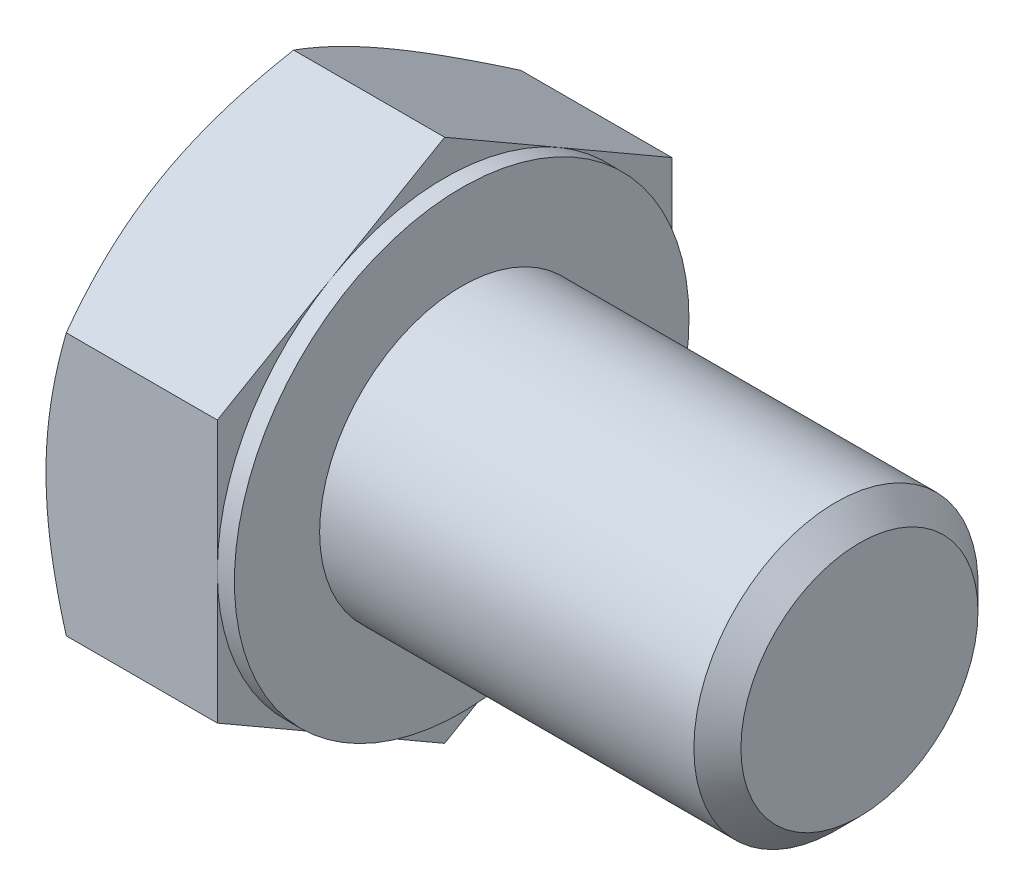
ISO-10303-21;
HEADER;
FILE_DESCRIPTION(('STEP AP214'),'2;1');
FILE_NAME('part.step','',(''),(''),'','','');
FILE_SCHEMA(('AUTOMOTIVE_DESIGN { 1 0 10303 214 1 1 1 1 }'));
ENDSEC;
DATA;
#1=APPLICATION_CONTEXT('core data for automotive mechanical design processes');
#2=APPLICATION_PROTOCOL_DEFINITION('international standard','automotive_design',2000,#1);
#3=PRODUCT_CONTEXT('',#1,'mechanical');
#4=PRODUCT('Part','Part','',(#3));
#5=PRODUCT_RELATED_PRODUCT_CATEGORY('part','',(#4));
#6=PRODUCT_DEFINITION_FORMATION('','',#4);
#7=PRODUCT_DEFINITION_CONTEXT('part definition',#1,'design');
#8=PRODUCT_DEFINITION('design','',#6,#7);
#9=PRODUCT_DEFINITION_SHAPE('','',#8);
#10=(LENGTH_UNIT() NAMED_UNIT(*) SI_UNIT(.MILLI.,.METRE.));
#11=(NAMED_UNIT(*) PLANE_ANGLE_UNIT() SI_UNIT($,.RADIAN.));
#12=(NAMED_UNIT(*) SI_UNIT($,.STERADIAN.) SOLID_ANGLE_UNIT());
#13=UNCERTAINTY_MEASURE_WITH_UNIT(LENGTH_MEASURE(1.E-05),#10,'distance_accuracy_value','');
#14=(GEOMETRIC_REPRESENTATION_CONTEXT(3) GLOBAL_UNCERTAINTY_ASSIGNED_CONTEXT((#13)) GLOBAL_UNIT_ASSIGNED_CONTEXT((#10,
#11,#12)) REPRESENTATION_CONTEXT('',''));
#15=CARTESIAN_POINT('',(0.,0.,0.));
#16=DIRECTION('',(0.,0.,1.));
#17=DIRECTION('',(1.,0.,0.));
#18=AXIS2_PLACEMENT_3D('',#15,#16,#17);
#19=CARTESIAN_POINT('',(6.63,4.618802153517,-8.));
#20=DIRECTION('',(0.,-0.866025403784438,0.500000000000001));
#21=DIRECTION('',(0.,-0.500000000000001,-0.866025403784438));
#22=AXIS2_PLACEMENT_3D('',#19,#20,#21);
#23=PLANE('',#22);
#24=DIRECTION('',(0.,0.500000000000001,0.866025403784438));
#25=VECTOR('',#24,1.);
#26=CARTESIAN_POINT('',(6.03,4.618802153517,-8.));
#27=LINE('',#26,#25);
#28=CARTESIAN_POINT('',(6.03,4.618802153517,-8.));
#29=VERTEX_POINT('',#28);
#30=CARTESIAN_POINT('',(6.03,6.92820323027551,-4.00000000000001));
#31=VERTEX_POINT('',#30);
#32=EDGE_CURVE('E169',#29,#31,#27,.T.);
#33=ORIENTED_EDGE('',*,*,#32,.F.);
#34=DIRECTION('',(-1.,0.,0.));
#35=VECTOR('',#34,1.);
#36=CARTESIAN_POINT('',(6.63,4.618802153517,-8.));
#37=LINE('',#36,#35);
#38=CARTESIAN_POINT('',(0.714531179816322,4.618802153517,-8.));
#39=VERTEX_POINT('',#38);
#40=EDGE_CURVE('E302',#29,#39,#37,.T.);
#41=ORIENTED_EDGE('',*,*,#40,.T.);
#42=CARTESIAN_POINT('',(0.714597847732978,9.23771977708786,0.000200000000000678));
#43=CARTESIAN_POINT('',(0.655990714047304,9.13619343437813,-0.175648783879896));
#44=CARTESIAN_POINT('',(0.600043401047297,9.03428856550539,-0.352153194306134));
#45=CARTESIAN_POINT('',(0.494201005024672,8.82965122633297,-0.706595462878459));
#46=CARTESIAN_POINT('',(0.444308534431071,8.72691841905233,-0.884533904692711));
#47=CARTESIAN_POINT('',(0.304692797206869,8.41707512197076,-1.42119823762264));
#48=CARTESIAN_POINT('',(0.225281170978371,8.20874154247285,-1.78204258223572));
#49=CARTESIAN_POINT('',(0.132161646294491,7.89697436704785,-2.32203917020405));
#50=CARTESIAN_POINT('',(0.105634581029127,7.79447216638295,-2.49957818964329));
#51=CARTESIAN_POINT('',(0.0611531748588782,7.58900421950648,-2.8554591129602));
#52=CARTESIAN_POINT('',(0.0431980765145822,7.4860385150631,-3.03380094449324));
#53=CARTESIAN_POINT('',(0.0163156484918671,7.27992981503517,-3.39079168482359));
#54=CARTESIAN_POINT('',(0.00737807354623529,7.17678715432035,-3.5694400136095));
#55=CARTESIAN_POINT('',(-0.00127769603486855,6.97040655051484,-3.92690170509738));
#56=CARTESIAN_POINT('',(-0.000996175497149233,6.86716861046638,-4.10571506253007));
#57=CARTESIAN_POINT('',(0.00814502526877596,6.67416139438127,-4.44001336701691));
#58=CARTESIAN_POINT('',(0.01588960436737,6.58437849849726,-4.59552190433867));
#59=CARTESIAN_POINT('',(0.0382011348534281,6.40502298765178,-4.90617476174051));
#60=CARTESIAN_POINT('',(0.0527685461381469,6.31545038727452,-5.06131905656));
#61=CARTESIAN_POINT('',(0.106360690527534,6.04707935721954,-5.52615131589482));
#62=CARTESIAN_POINT('',(0.155268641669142,5.86875596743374,-5.83501648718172));
#63=CARTESIAN_POINT('',(0.277539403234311,5.51021755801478,-6.4560232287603));
#64=CARTESIAN_POINT('',(0.351420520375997,5.3300482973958,-6.76808554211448));
#65=CARTESIAN_POINT('',(0.519100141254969,4.97239658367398,-7.38755648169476));
#66=CARTESIAN_POINT('',(0.612859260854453,4.79490955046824,-7.69497304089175));
#67=CARTESIAN_POINT('',(0.714597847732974,4.61868668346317,-8.0002));
#68=B_SPLINE_CURVE_WITH_KNOTS('',3,(#42,#43,#44,#45,#46,#47,#48,#49,#50,#51,#52,#53,#54,#55,#56,
#57,#58,#59,#60,#61,#62,#63,#64,#65,#66,#67),.UNSPECIFIED.,.F.,.F.,(4,2,2,2,2,2,2,2,2,2,2,2,4),
(0.,0.633973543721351,1.26821965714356,2.53934712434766,3.15934343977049,3.77928496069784,
4.39852133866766,5.01773858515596,5.55680239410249,6.09590254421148,7.17487077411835,
8.27776850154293,9.37850115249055),.UNSPECIFIED.);
#69=CARTESIAN_POINT('',(0.,6.92820323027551,-4.00000000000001));
#70=VERTEX_POINT('',#69);
#71=EDGE_CURVE('E223',#70,#39,#68,.T.);
#72=ORIENTED_EDGE('',*,*,#71,.F.);
#73=CARTESIAN_POINT('',(0.714531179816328,9.23760430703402,0.));
#74=VERTEX_POINT('',#73);
#75=EDGE_CURVE('E60',#74,#70,#68,.T.);
#76=ORIENTED_EDGE('',*,*,#75,.F.);
#77=DIRECTION('',(-1.,0.,0.));
#78=VECTOR('',#77,1.);
#79=CARTESIAN_POINT('',(6.63,9.23760430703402,0.));
#80=LINE('',#79,#78);
#81=CARTESIAN_POINT('',(6.03,9.23760430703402,0.));
#82=VERTEX_POINT('',#81);
#83=EDGE_CURVE('E252',#82,#74,#80,.T.);
#84=ORIENTED_EDGE('',*,*,#83,.F.);
#85=EDGE_CURVE('E167',#31,#82,#27,.T.);
#86=ORIENTED_EDGE('',*,*,#85,.F.);
#87=EDGE_LOOP('',(#33,#41,#72,#76,#84,#86));
#88=FACE_BOUND('',#87,.T.);
#89=ADVANCED_FACE('F37',(#88),#23,.F.);
#90=CARTESIAN_POINT('',(6.63,9.23760430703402,0.));
#91=DIRECTION('',(0.,-0.866025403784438,-0.500000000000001));
#92=DIRECTION('',(0.,0.500000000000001,-0.866025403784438));
#93=AXIS2_PLACEMENT_3D('',#90,#91,#92);
#94=PLANE('',#93);
#95=DIRECTION('',(0.,-0.500000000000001,0.866025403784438));
#96=VECTOR('',#95,1.);
#97=CARTESIAN_POINT('',(6.03,9.23760430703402,0.));
#98=LINE('',#97,#96);
#99=CARTESIAN_POINT('',(6.03,6.9282032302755,4.00000000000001));
#100=VERTEX_POINT('',#99);
#101=EDGE_CURVE('E166',#82,#100,#98,.T.);
#102=ORIENTED_EDGE('',*,*,#101,.F.);
#103=ORIENTED_EDGE('',*,*,#83,.T.);
#104=CARTESIAN_POINT('',(0.714597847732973,4.61868668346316,8.0002));
#105=CARTESIAN_POINT('',(0.655990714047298,4.72021302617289,7.8243512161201));
#106=CARTESIAN_POINT('',(0.60004340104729,4.82211789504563,7.64784680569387));
#107=CARTESIAN_POINT('',(0.494201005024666,5.02675523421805,7.29340453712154));
#108=CARTESIAN_POINT('',(0.444308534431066,5.12948804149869,7.11546609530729));
#109=CARTESIAN_POINT('',(0.304692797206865,5.43933133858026,6.57880176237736));
#110=CARTESIAN_POINT('',(0.225281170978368,5.64766491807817,6.21795741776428));
#111=CARTESIAN_POINT('',(0.132161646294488,5.95943209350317,5.67796082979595));
#112=CARTESIAN_POINT('',(0.105634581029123,6.06193429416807,5.50042181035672));
#113=CARTESIAN_POINT('',(0.0611531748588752,6.26740224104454,5.1445408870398));
#114=CARTESIAN_POINT('',(0.0431980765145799,6.37036794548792,4.96619905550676));
#115=CARTESIAN_POINT('',(0.0163156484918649,6.57647664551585,4.60920831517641));
#116=CARTESIAN_POINT('',(0.00737807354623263,6.67961930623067,4.4305599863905));
#117=CARTESIAN_POINT('',(-0.00127769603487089,6.88599991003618,4.07309829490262));
#118=CARTESIAN_POINT('',(-0.000996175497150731,6.98923785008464,3.89428493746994));
#119=CARTESIAN_POINT('',(0.00814502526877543,7.18224506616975,3.5599866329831));
#120=CARTESIAN_POINT('',(0.0158896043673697,7.27202796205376,3.40447809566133));
#121=CARTESIAN_POINT('',(0.0382011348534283,7.45138347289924,3.09382523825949));
#122=CARTESIAN_POINT('',(0.0527685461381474,7.54095607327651,2.93868094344));
#123=CARTESIAN_POINT('',(0.106360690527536,7.80932710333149,2.47384868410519));
#124=CARTESIAN_POINT('',(0.155268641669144,7.98765049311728,2.16498351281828));
#125=CARTESIAN_POINT('',(0.277539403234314,8.34618890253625,1.5439767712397));
#126=CARTESIAN_POINT('',(0.351420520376,8.52635816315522,1.23191445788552));
#127=CARTESIAN_POINT('',(0.519100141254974,8.88400987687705,0.612443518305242));
#128=CARTESIAN_POINT('',(0.612859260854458,9.06149691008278,0.30502695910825));
#129=CARTESIAN_POINT('',(0.714597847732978,9.23771977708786,-0.000200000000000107));
#130=B_SPLINE_CURVE_WITH_KNOTS('',3,(#104,#105,#106,#107,#108,#109,#110,#111,#112,#113,#114,
#115,#116,#117,#118,#119,#120,#121,#122,#123,#124,#125,#126,#127,#128,#129),.UNSPECIFIED.,.F.,
.F.,(4,2,2,2,2,2,2,2,2,2,2,2,4),(0.,0.63397354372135,1.26821965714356,2.53934712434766,
3.15934343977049,3.77928496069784,4.39852133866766,5.01773858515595,5.55680239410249,
6.09590254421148,7.17487077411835,8.27776850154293,9.37850115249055),.UNSPECIFIED.);
#131=CARTESIAN_POINT('',(0.,6.9282032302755,4.00000000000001));
#132=VERTEX_POINT('',#131);
#133=EDGE_CURVE('E220',#132,#74,#130,.T.);
#134=ORIENTED_EDGE('',*,*,#133,.F.);
#135=CARTESIAN_POINT('',(0.714531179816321,4.618802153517,8.));
#136=VERTEX_POINT('',#135);
#137=EDGE_CURVE('E233',#136,#132,#130,.T.);
#138=ORIENTED_EDGE('',*,*,#137,.F.);
#139=DIRECTION('',(-1.,0.,0.));
#140=VECTOR('',#139,1.);
#141=CARTESIAN_POINT('',(6.63,4.618802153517,8.));
#142=LINE('',#141,#140);
#143=CARTESIAN_POINT('',(6.03,4.618802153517,8.));
#144=VERTEX_POINT('',#143);
#145=EDGE_CURVE('E258',#144,#136,#142,.T.);
#146=ORIENTED_EDGE('',*,*,#145,.F.);
#147=EDGE_CURVE('E134',#100,#144,#98,.T.);
#148=ORIENTED_EDGE('',*,*,#147,.F.);
#149=EDGE_LOOP('',(#102,#103,#134,#138,#146,#148));
#150=FACE_BOUND('',#149,.T.);
#151=ADVANCED_FACE('F240',(#150),#94,.F.);
#152=CARTESIAN_POINT('',(6.63,4.618802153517,8.));
#153=DIRECTION('',(0.,0.,-1.));
#154=DIRECTION('',(-1.,0.,0.));
#155=AXIS2_PLACEMENT_3D('',#152,#153,#154);
#156=PLANE('',#155);
#157=DIRECTION('',(0.,-1.,0.));
#158=VECTOR('',#157,1.);
#159=CARTESIAN_POINT('',(6.03,4.618802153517,8.));
#160=LINE('',#159,#158);
#161=CARTESIAN_POINT('',(6.03,0.,8.));
#162=VERTEX_POINT('',#161);
#163=EDGE_CURVE('E128',#144,#162,#160,.T.);
#164=ORIENTED_EDGE('',*,*,#163,.F.);
#165=ORIENTED_EDGE('',*,*,#145,.T.);
#166=CARTESIAN_POINT('',(4.02490590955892,-12.6546855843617,8.));
#167=CARTESIAN_POINT('',(3.85338487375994,-12.3031246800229,8.));
#168=CARTESIAN_POINT('',(3.68343819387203,-11.9507829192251,8.));
#169=CARTESIAN_POINT('',(3.34757427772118,-11.2441233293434,8.));
#170=CARTESIAN_POINT('',(3.18165763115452,-10.889805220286,8.));
#171=CARTESIAN_POINT('',(2.85395194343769,-10.1770689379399,8.));
#172=CARTESIAN_POINT('',(2.69218824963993,-9.81863907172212,8.));
#173=CARTESIAN_POINT('',(2.37495726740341,-9.09901412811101,8.));
#174=CARTESIAN_POINT('',(2.21948969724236,-8.73781917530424,8.));
#175=CARTESIAN_POINT('',(1.91124909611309,-7.99950051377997,8.));
#176=CARTESIAN_POINT('',(1.75875676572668,-7.62225899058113,8.));
#177=CARTESIAN_POINT('',(1.46472411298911,-6.86345576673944,8.));
#178=CARTESIAN_POINT('',(1.32318498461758,-6.4818936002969,8.));
#179=CARTESIAN_POINT('',(1.05459432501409,-5.71447512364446,8.));
#180=CARTESIAN_POINT('',(0.927515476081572,-5.32862847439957,8.));
#181=CARTESIAN_POINT('',(0.691757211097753,-4.55141880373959,8.));
#182=CARTESIAN_POINT('',(0.583072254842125,-4.16005748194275,8.));
#183=CARTESIAN_POINT('',(0.389750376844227,-3.37376378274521,8.));
#184=CARTESIAN_POINT('',(0.304973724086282,-2.9788666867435,8.));
#185=CARTESIAN_POINT('',(0.199275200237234,-2.38273452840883,8.));
#186=CARTESIAN_POINT('',(0.167618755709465,-2.18337977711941,8.));
#187=CARTESIAN_POINT('',(0.112075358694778,-1.78359737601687,8.));
#188=CARTESIAN_POINT('',(0.0881876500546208,-1.58316983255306,8.));
#189=CARTESIAN_POINT('',(0.0489706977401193,-1.18423542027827,8.));
#190=CARTESIAN_POINT('',(0.0335291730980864,-0.985739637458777,8.));
#191=CARTESIAN_POINT('',(0.0110629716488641,-0.588272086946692,8.));
#192=CARTESIAN_POINT('',(0.00403814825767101,-0.389300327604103,8.));
#193=CARTESIAN_POINT('',(-0.00142584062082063,0.00876221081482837,8.));
#194=CARTESIAN_POINT('',(0.000134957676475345,0.207852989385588,8.));
#195=CARTESIAN_POINT('',(0.011801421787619,0.605786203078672,8.));
#196=CARTESIAN_POINT('',(0.0219074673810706,0.804628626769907,8.));
#197=CARTESIAN_POINT('',(0.0557165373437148,1.27520491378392,8.));
#198=CARTESIAN_POINT('',(0.0830672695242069,1.54668291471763,8.));
#199=CARTESIAN_POINT('',(0.152259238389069,2.08777092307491,8.));
#200=CARTESIAN_POINT('',(0.194102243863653,2.35738069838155,8.));
#201=CARTESIAN_POINT('',(0.339163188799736,3.16301774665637,8.));
#202=CARTESIAN_POINT('',(0.461891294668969,3.69558688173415,8.));
#203=CARTESIAN_POINT('',(0.676586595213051,4.49226053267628,8.));
#204=CARTESIAN_POINT('',(0.75430185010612,4.76044512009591,8.));
#205=CARTESIAN_POINT('',(0.918275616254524,5.29421544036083,8.));
#206=CARTESIAN_POINT('',(1.00453419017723,5.55980115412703,8.));
#207=CARTESIAN_POINT('',(1.18417203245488,6.08844836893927,8.));
#208=CARTESIAN_POINT('',(1.2775493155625,6.35151055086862,8.));
#209=CARTESIAN_POINT('',(1.47027924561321,6.87542420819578,8.));
#210=CARTESIAN_POINT('',(1.56963178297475,7.13627572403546,8.));
#211=CARTESIAN_POINT('',(1.830617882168,7.80218874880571,8.));
#212=CARTESIAN_POINT('',(1.99585030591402,8.20583800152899,8.));
#213=CARTESIAN_POINT('',(2.33560643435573,9.00922090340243,8.));
#214=CARTESIAN_POINT('',(2.51013099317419,9.40895418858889,8.));
#215=CARTESIAN_POINT('',(2.86641484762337,10.2053302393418,8.));
#216=CARTESIAN_POINT('',(3.04817649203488,10.6019719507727,8.));
#217=CARTESIAN_POINT('',(3.41731474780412,11.3926098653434,8.));
#218=CARTESIAN_POINT('',(3.60469117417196,11.7866061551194,8.));
#219=CARTESIAN_POINT('',(3.9841797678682,12.5730081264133,8.));
#220=CARTESIAN_POINT('',(4.17629837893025,12.9654106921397,8.));
#221=CARTESIAN_POINT('',(4.56413460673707,13.7484335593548,8.));
#222=CARTESIAN_POINT('',(4.75985224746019,14.1390538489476,8.));
#223=CARTESIAN_POINT('',(5.15417790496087,14.9187386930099,8.));
#224=CARTESIAN_POINT('',(5.3527853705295,15.3078035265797,8.));
#225=CARTESIAN_POINT('',(5.75241277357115,16.0846929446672,8.));
#226=CARTESIAN_POINT('',(5.95343272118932,16.4725175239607,8.));
#227=CARTESIAN_POINT('',(6.52023157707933,17.5591699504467,8.));
#228=CARTESIAN_POINT('',(6.8882666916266,18.2568207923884,8.));
#229=CARTESIAN_POINT('',(7.62911645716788,19.6496204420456,8.));
#230=CARTESIAN_POINT('',(8.00193135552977,20.3447691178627,8.));
#231=CARTESIAN_POINT('',(8.74998840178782,21.7309493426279,8.));
#232=CARTESIAN_POINT('',(9.1252192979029,22.4219869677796,8.));
#233=CARTESIAN_POINT('',(9.69012625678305,23.4573861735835,8.));
#234=CARTESIAN_POINT('',(9.87876537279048,23.8023143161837,8.));
#235=CARTESIAN_POINT('',(10.2566598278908,24.4918321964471,8.));
#236=CARTESIAN_POINT('',(10.4459151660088,24.8364219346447,8.));
#237=CARTESIAN_POINT('',(10.635441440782,25.1808626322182,8.));
#238=B_SPLINE_CURVE_WITH_KNOTS('',3,(#166,#167,#168,#169,#170,#171,#172,#173,#174,#175,#176,
#177,#178,#179,#180,#181,#182,#183,#184,#185,#186,#187,#188,#189,#190,#191,#192,#193,#194,#195,
#196,#197,#198,#199,#200,#201,#202,#203,#204,#205,#206,#207,#208,#209,#210,#211,#212,#213,#214,
#215,#216,#217,#218,#219,#220,#221,#222,#223,#224,#225,#226,#227,#228,#229,#230,#231,#232,#233,
#234,#235,#236,#237),.UNSPECIFIED.,.F.,.F.,(4,2,2,2,2,2,2,2,2,2,2,2,2,2,2,2,2,2,2,2,2,2,2,2,2,2,
2,2,2,2,2,2,2,2,2,4),(0.,1.1735253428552,2.34722138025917,3.52689945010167,4.70652467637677,
5.92708317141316,7.1477745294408,8.36612012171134,9.5840980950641,10.7948027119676,
11.4002329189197,12.0056041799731,12.6027191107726,13.1998236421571,13.7969256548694,
14.3940542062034,15.2121538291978,16.0303533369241,17.6675489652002,18.5051258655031,
19.3427089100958,20.1800592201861,21.0173941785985,22.3257038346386,23.6341339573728,
24.9429922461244,26.2518074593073,27.5625113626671,28.8732240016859,30.1836898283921,
31.4941611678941,33.8604585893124,36.2268789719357,38.5858914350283,39.7653150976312,
40.9447368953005),.UNSPECIFIED.);
#239=CARTESIAN_POINT('',(0.,0.,8.));
#240=VERTEX_POINT('',#239);
#241=EDGE_CURVE('E234',#240,#136,#238,.T.);
#242=ORIENTED_EDGE('',*,*,#241,.F.);
#243=CARTESIAN_POINT('',(0.714531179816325,-4.61880215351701,8.));
#244=VERTEX_POINT('',#243);
#245=EDGE_CURVE('E311',#244,#240,#238,.T.);
#246=ORIENTED_EDGE('',*,*,#245,.F.);
#247=DIRECTION('',(-1.,0.,0.));
#248=VECTOR('',#247,1.);
#249=CARTESIAN_POINT('',(6.63,-4.61880215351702,8.));
#250=LINE('',#249,#248);
#251=CARTESIAN_POINT('',(6.03,-4.61880215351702,8.));
#252=VERTEX_POINT('',#251);
#253=EDGE_CURVE('E160',#252,#244,#250,.T.);
#254=ORIENTED_EDGE('',*,*,#253,.F.);
#255=EDGE_CURVE('E138',#162,#252,#160,.T.);
#256=ORIENTED_EDGE('',*,*,#255,.F.);
#257=EDGE_LOOP('',(#164,#165,#242,#246,#254,#256));
#258=FACE_BOUND('',#257,.T.);
#259=ADVANCED_FACE('F158',(#258),#156,.F.);
#260=CARTESIAN_POINT('',(6.63,-9.23760430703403,0.));
#261=DIRECTION('',(0.,0.866025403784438,-0.500000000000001));
#262=DIRECTION('',(0.,0.500000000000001,0.866025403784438));
#263=AXIS2_PLACEMENT_3D('',#260,#261,#262);
#264=PLANE('',#263);
#265=DIRECTION('',(0.,-0.500000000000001,-0.866025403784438));
#266=VECTOR('',#265,1.);
#267=CARTESIAN_POINT('',(6.03,-9.23760430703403,0.));
#268=LINE('',#267,#266);
#269=CARTESIAN_POINT('',(6.03,-6.92820323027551,4.00000000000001));
#270=VERTEX_POINT('',#269);
#271=EDGE_CURVE('E145',#252,#270,#268,.T.);
#272=ORIENTED_EDGE('',*,*,#271,.F.);
#273=ORIENTED_EDGE('',*,*,#253,.T.);
#274=CARTESIAN_POINT('',(0.714597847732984,-9.23771977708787,-0.000199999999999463));
#275=CARTESIAN_POINT('',(0.655990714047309,-9.13619343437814,0.175648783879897));
#276=CARTESIAN_POINT('',(0.600043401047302,-9.0342885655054,0.352153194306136));
#277=CARTESIAN_POINT('',(0.494201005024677,-8.82965122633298,0.706595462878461));
#278=CARTESIAN_POINT('',(0.444308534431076,-8.72691841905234,0.884533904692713));
#279=CARTESIAN_POINT('',(0.304692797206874,-8.41707512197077,1.42119823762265));
#280=CARTESIAN_POINT('',(0.225281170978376,-8.20874154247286,1.78204258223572));
#281=CARTESIAN_POINT('',(0.132161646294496,-7.89697436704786,2.32203917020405));
#282=CARTESIAN_POINT('',(0.105634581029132,-7.79447216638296,2.49957818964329));
#283=CARTESIAN_POINT('',(0.0611531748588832,-7.58900421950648,2.8554591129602));
#284=CARTESIAN_POINT('',(0.0431980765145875,-7.48603851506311,3.03380094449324));
#285=CARTESIAN_POINT('',(0.0163156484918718,-7.27992981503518,3.3907916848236));
#286=CARTESIAN_POINT('',(0.00737807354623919,-7.17678715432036,3.56944001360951));
#287=CARTESIAN_POINT('',(-0.00127769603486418,-6.97040655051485,3.92690170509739));
#288=CARTESIAN_POINT('',(-0.000996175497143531,-6.86716861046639,4.10571506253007));
#289=CARTESIAN_POINT('',(0.00814502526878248,-6.67416139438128,4.44001336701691));
#290=CARTESIAN_POINT('',(0.0158896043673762,-6.58437849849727,4.59552190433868));
#291=CARTESIAN_POINT('',(0.0382011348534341,-6.40502298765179,4.90617476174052));
#292=CARTESIAN_POINT('',(0.052768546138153,-6.31545038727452,5.06131905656));
#293=CARTESIAN_POINT('',(0.106360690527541,-6.04707935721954,5.52615131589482));
#294=CARTESIAN_POINT('',(0.155268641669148,-5.86875596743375,5.83501648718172));
#295=CARTESIAN_POINT('',(0.277539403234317,-5.51021755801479,6.4560232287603));
#296=CARTESIAN_POINT('',(0.351420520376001,-5.33004829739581,6.76808554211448));
#297=CARTESIAN_POINT('',(0.519100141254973,-4.97239658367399,7.38755648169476));
#298=CARTESIAN_POINT('',(0.612859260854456,-4.79490955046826,7.69497304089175));
#299=CARTESIAN_POINT('',(0.714597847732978,-4.61868668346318,8.0002));
#300=B_SPLINE_CURVE_WITH_KNOTS('',3,(#274,#275,#276,#277,#278,#279,#280,#281,#282,#283,#284,
#285,#286,#287,#288,#289,#290,#291,#292,#293,#294,#295,#296,#297,#298,#299),.UNSPECIFIED.,.F.,
.F.,(4,2,2,2,2,2,2,2,2,2,2,2,4),(0.,0.633973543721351,1.26821965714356,2.53934712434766,
3.15934343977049,3.77928496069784,4.39852133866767,5.01773858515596,5.55680239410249,
6.09590254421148,7.17487077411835,8.27776850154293,9.37850115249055),.UNSPECIFIED.);
#301=CARTESIAN_POINT('',(0.,-6.92820323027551,4.00000000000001));
#302=VERTEX_POINT('',#301);
#303=EDGE_CURVE('E222',#302,#244,#300,.T.);
#304=ORIENTED_EDGE('',*,*,#303,.F.);
#305=CARTESIAN_POINT('',(0.714531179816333,-9.23760430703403,0.));
#306=VERTEX_POINT('',#305);
#307=EDGE_CURVE('E214',#306,#302,#300,.T.);
#308=ORIENTED_EDGE('',*,*,#307,.F.);
#309=DIRECTION('',(-1.,0.,0.));
#310=VECTOR('',#309,1.);
#311=CARTESIAN_POINT('',(6.63,-9.23760430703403,0.));
#312=LINE('',#311,#310);
#313=CARTESIAN_POINT('',(6.03,-9.23760430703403,0.));
#314=VERTEX_POINT('',#313);
#315=EDGE_CURVE('E296',#314,#306,#312,.T.);
#316=ORIENTED_EDGE('',*,*,#315,.F.);
#317=EDGE_CURVE('E161',#270,#314,#268,.T.);
#318=ORIENTED_EDGE('',*,*,#317,.F.);
#319=EDGE_LOOP('',(#272,#273,#304,#308,#316,#318));
#320=FACE_BOUND('',#319,.T.);
#321=ADVANCED_FACE('F206',(#320),#264,.F.);
#322=CARTESIAN_POINT('',(6.63,-4.61880215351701,-8.));
#323=DIRECTION('',(0.,0.866025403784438,0.500000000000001));
#324=DIRECTION('',(0.,-0.500000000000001,0.866025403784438));
#325=AXIS2_PLACEMENT_3D('',#322,#323,#324);
#326=PLANE('',#325);
#327=DIRECTION('',(0.,0.500000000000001,-0.866025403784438));
#328=VECTOR('',#327,1.);
#329=CARTESIAN_POINT('',(6.03,-4.61880215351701,-8.));
#330=LINE('',#329,#328);
#331=CARTESIAN_POINT('',(6.03,-6.92820323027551,-4.));
#332=VERTEX_POINT('',#331);
#333=EDGE_CURVE('E591',#314,#332,#330,.T.);
#334=ORIENTED_EDGE('',*,*,#333,.F.);
#335=ORIENTED_EDGE('',*,*,#315,.T.);
#336=CARTESIAN_POINT('',(0.714597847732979,-4.61868668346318,-8.0002));
#337=CARTESIAN_POINT('',(0.655990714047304,-4.7202130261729,-7.82435121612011));
#338=CARTESIAN_POINT('',(0.600043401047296,-4.82211789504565,-7.64784680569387));
#339=CARTESIAN_POINT('',(0.494201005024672,-5.02675523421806,-7.29340453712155));
#340=CARTESIAN_POINT('',(0.444308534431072,-5.1294880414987,-7.11546609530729));
#341=CARTESIAN_POINT('',(0.304692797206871,-5.43933133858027,-6.57880176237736));
#342=CARTESIAN_POINT('',(0.225281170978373,-5.64766491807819,-6.21795741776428));
#343=CARTESIAN_POINT('',(0.132161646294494,-5.95943209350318,-5.67796082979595));
#344=CARTESIAN_POINT('',(0.10563458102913,-6.06193429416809,-5.50042181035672));
#345=CARTESIAN_POINT('',(0.0611531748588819,-6.26740224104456,-5.1445408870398));
#346=CARTESIAN_POINT('',(0.0431980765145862,-6.37036794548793,-4.96619905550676));
#347=CARTESIAN_POINT('',(0.0163156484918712,-6.57647664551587,-4.60920831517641));
#348=CARTESIAN_POINT('',(0.00737807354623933,-6.67961930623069,-4.4305599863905));
#349=CARTESIAN_POINT('',(-0.00127769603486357,-6.88599991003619,-4.07309829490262));
#350=CARTESIAN_POINT('',(-0.000996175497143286,-6.98923785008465,-3.89428493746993));
#351=CARTESIAN_POINT('',(0.00814502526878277,-7.18224506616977,-3.5599866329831));
#352=CARTESIAN_POINT('',(0.0158896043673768,-7.27202796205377,-3.40447809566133));
#353=CARTESIAN_POINT('',(0.0382011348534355,-7.45138347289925,-3.09382523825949));
#354=CARTESIAN_POINT('',(0.0527685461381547,-7.54095607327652,-2.93868094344));
#355=CARTESIAN_POINT('',(0.106360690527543,-7.8093271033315,-2.47384868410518));
#356=CARTESIAN_POINT('',(0.155268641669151,-7.98765049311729,-2.16498351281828));
#357=CARTESIAN_POINT('',(0.277539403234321,-8.34618890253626,-1.5439767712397));
#358=CARTESIAN_POINT('',(0.351420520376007,-8.52635816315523,-1.23191445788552));
#359=CARTESIAN_POINT('',(0.51910014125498,-8.88400987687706,-0.61244351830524));
#360=CARTESIAN_POINT('',(0.612859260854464,-9.06149691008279,-0.305026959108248));
#361=CARTESIAN_POINT('',(0.714597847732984,-9.23771977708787,0.000200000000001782));
#362=B_SPLINE_CURVE_WITH_KNOTS('',3,(#336,#337,#338,#339,#340,#341,#342,#343,#344,#345,#346,
#347,#348,#349,#350,#351,#352,#353,#354,#355,#356,#357,#358,#359,#360,#361),.UNSPECIFIED.,.F.,
.F.,(4,2,2,2,2,2,2,2,2,2,2,2,4),(0.,0.63397354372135,1.26821965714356,2.53934712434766,
3.15934343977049,3.77928496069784,4.39852133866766,5.01773858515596,5.55680239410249,
6.09590254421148,7.17487077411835,8.27776850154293,9.37850115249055),.UNSPECIFIED.);
#363=CARTESIAN_POINT('',(0.,-6.92820323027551,-4.));
#364=VERTEX_POINT('',#363);
#365=EDGE_CURVE('E221',#364,#306,#362,.T.);
#366=ORIENTED_EDGE('',*,*,#365,.F.);
#367=CARTESIAN_POINT('',(0.714531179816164,-4.61880215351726,-8.));
#368=VERTEX_POINT('',#367);
#369=EDGE_CURVE('E183',#368,#364,#362,.T.);
#370=ORIENTED_EDGE('',*,*,#369,.F.);
#371=DIRECTION('',(-1.,0.,0.));
#372=VECTOR('',#371,1.);
#373=CARTESIAN_POINT('',(6.63,-4.61880215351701,-8.));
#374=LINE('',#373,#372);
#375=CARTESIAN_POINT('',(6.03,-4.61880215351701,-8.));
#376=VERTEX_POINT('',#375);
#377=EDGE_CURVE('E303',#376,#368,#374,.T.);
#378=ORIENTED_EDGE('',*,*,#377,.F.);
#379=EDGE_CURVE('E156',#332,#376,#330,.T.);
#380=ORIENTED_EDGE('',*,*,#379,.F.);
#381=EDGE_LOOP('',(#334,#335,#366,#370,#378,#380));
#382=FACE_BOUND('',#381,.T.);
#383=ADVANCED_FACE('F199',(#382),#326,.F.);
#384=CARTESIAN_POINT('',(6.63,4.618802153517,-8.));
#385=DIRECTION('',(0.,0.,1.));
#386=DIRECTION('',(0.,-1.,0.));
#387=AXIS2_PLACEMENT_3D('',#384,#385,#386);
#388=PLANE('',#387);
#389=DIRECTION('',(0.,1.,0.));
#390=VECTOR('',#389,1.);
#391=CARTESIAN_POINT('',(6.03,4.618802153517,-8.));
#392=LINE('',#391,#390);
#393=CARTESIAN_POINT('',(6.03,0.,-8.));
#394=VERTEX_POINT('',#393);
#395=EDGE_CURVE('E11',#376,#394,#392,.T.);
#396=ORIENTED_EDGE('',*,*,#395,.F.);
#397=ORIENTED_EDGE('',*,*,#377,.T.);
#398=CARTESIAN_POINT('',(4.02490591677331,-12.654685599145,-8.00000000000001));
#399=CARTESIAN_POINT('',(3.85338488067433,-12.3031246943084,-8.00000000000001));
#400=CARTESIAN_POINT('',(3.6834382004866,-11.9507829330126,-8.00000000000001));
#401=CARTESIAN_POINT('',(3.34757428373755,-11.2441233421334,-8.00000000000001));
#402=CARTESIAN_POINT('',(3.18165763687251,-10.8898052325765,-8.00000000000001));
#403=CARTESIAN_POINT('',(2.8539519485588,-10.177068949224,-8.00000000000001));
#404=CARTESIAN_POINT('',(2.6921882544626,-9.81863908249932,-8.00000000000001));
#405=CARTESIAN_POINT('',(2.37495727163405,-9.09901413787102,-8.00000000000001));
#406=CARTESIAN_POINT('',(2.21948970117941,-8.73781918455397,-8.00000000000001));
#407=CARTESIAN_POINT('',(1.91124909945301,-7.99950052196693,-8.00000000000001));
#408=CARTESIAN_POINT('',(1.75875676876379,-7.62225899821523,-8.00000000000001));
#409=CARTESIAN_POINT('',(1.46472411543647,-6.86345577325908,-8.00000000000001));
#410=CARTESIAN_POINT('',(1.32318498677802,-6.48189360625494,-8.));
#411=CARTESIAN_POINT('',(1.05459432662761,-5.71447512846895,-8.));
#412=CARTESIAN_POINT('',(0.927515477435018,-5.32862847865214,-8.));
#413=CARTESIAN_POINT('',(0.691757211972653,-4.55141880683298,-8.));
#414=CARTESIAN_POINT('',(0.583072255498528,-4.1600574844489,-8.));
#415=CARTESIAN_POINT('',(0.389750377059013,-3.37376378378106,-8.));
#416=CARTESIAN_POINT('',(0.304973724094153,-2.97886668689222,-8.00000000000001));
#417=CARTESIAN_POINT('',(0.199275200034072,-2.38273452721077,-8.));
#418=CARTESIAN_POINT('',(0.167618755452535,-2.18337977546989,-8.));
#419=CARTESIAN_POINT('',(0.11207535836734,-1.78359737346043,-8.));
#420=CARTESIAN_POINT('',(0.0881876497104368,-1.58316982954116,-8.));
#421=CARTESIAN_POINT('',(0.0489706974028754,-1.18423541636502,-8.));
#422=CARTESIAN_POINT('',(0.0335291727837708,-0.985739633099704,-8.));
#423=CARTESIAN_POINT('',(0.0110629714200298,-0.588272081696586,-8.));
#424=CARTESIAN_POINT('',(0.00403814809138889,-0.389300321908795,-8.));
#425=CARTESIAN_POINT('',(-0.00142584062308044,0.00876221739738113,-8.));
#426=CARTESIAN_POINT('',(0.000134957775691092,0.207852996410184,-8.));
#427=CARTESIAN_POINT('',(0.0118014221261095,0.605786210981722,-8.));
#428=CARTESIAN_POINT('',(0.0219074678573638,0.804628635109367,-8.));
#429=CARTESIAN_POINT('',(0.0557165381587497,1.27520492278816,-8.));
#430=CARTESIAN_POINT('',(0.0830672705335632,1.54668292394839,-8.));
#431=CARTESIAN_POINT('',(0.152259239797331,2.08777093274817,-8.));
#432=CARTESIAN_POINT('',(0.1941022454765,2.35738070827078,-8.));
#433=CARTESIAN_POINT('',(0.339163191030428,3.16301775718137,-8.));
#434=CARTESIAN_POINT('',(0.461891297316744,3.6955868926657,-8.));
#435=CARTESIAN_POINT('',(0.676586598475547,4.49226054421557,-8.));
#436=CARTESIAN_POINT('',(0.754301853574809,4.76044513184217,-8.));
#437=CARTESIAN_POINT('',(0.918275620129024,5.29421545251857,-8.));
#438=CARTESIAN_POINT('',(1.00453419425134,5.55980116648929,-8.));
#439=CARTESIAN_POINT('',(1.18417203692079,6.08844838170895,-8.));
#440=CARTESIAN_POINT('',(1.27754932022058,6.35151056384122,-8.));
#441=CARTESIAN_POINT('',(1.47027925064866,6.87542422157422,-8.));
#442=CARTESIAN_POINT('',(1.5696317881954,7.13627573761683,-8.));
#443=CARTESIAN_POINT('',(1.83061788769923,7.80218876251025,-8.));
#444=CARTESIAN_POINT('',(1.99585031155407,8.20583801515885,-8.));
#445=CARTESIAN_POINT('',(2.33560644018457,9.00922091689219,-8.));
#446=CARTESIAN_POINT('',(2.510130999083,9.40895420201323,-8.));
#447=CARTESIAN_POINT('',(2.86641485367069,10.2053302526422,-8.));
#448=CARTESIAN_POINT('',(3.04817649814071,10.6019719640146,-8.));
#449=CARTESIAN_POINT('',(3.41731475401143,11.3926098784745,-8.));
#450=CARTESIAN_POINT('',(3.60469118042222,11.7866061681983,-8.));
#451=CARTESIAN_POINT('',(3.98417977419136,12.5730081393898,-8.));
#452=CARTESIAN_POINT('',(4.17629838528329,12.9654107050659,-8.));
#453=CARTESIAN_POINT('',(4.56413461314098,13.7484335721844,-8.));
#454=CARTESIAN_POINT('',(4.75985225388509,14.1390538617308,-8.));
#455=CARTESIAN_POINT('',(5.15417791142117,14.9187387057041,-8.));
#456=CARTESIAN_POINT('',(5.35278537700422,15.3078035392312,-8.));
#457=CARTESIAN_POINT('',(5.75241278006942,16.0846929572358,-8.));
#458=CARTESIAN_POINT('',(5.95343272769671,16.4725175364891,-7.99999999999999));
#459=CARTESIAN_POINT('',(6.5202315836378,17.559169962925,-7.99999999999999));
#460=CARTESIAN_POINT('',(6.88826669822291,18.2568208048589,-7.99999999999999));
#461=CARTESIAN_POINT('',(7.62911646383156,19.6496204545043,-7.99999999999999));
#462=CARTESIAN_POINT('',(8.00193136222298,20.3447691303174,-7.99999999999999));
#463=CARTESIAN_POINT('',(8.74998840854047,21.7309493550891,-7.99999999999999));
#464=CARTESIAN_POINT('',(9.12521930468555,22.4219869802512,-7.99999999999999));
#465=CARTESIAN_POINT('',(9.69012626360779,23.4573861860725,-7.99999999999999));
#466=CARTESIAN_POINT('',(9.8787653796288,23.8023143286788,-7.99999999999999));
#467=CARTESIAN_POINT('',(10.2566598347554,24.4918322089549,-7.99999999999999));
#468=CARTESIAN_POINT('',(10.4459151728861,24.836421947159,-7.99999999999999));
#469=CARTESIAN_POINT('',(10.6354414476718,25.1808626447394,-7.99999999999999));
#470=B_SPLINE_CURVE_WITH_KNOTS('',3,(#398,#399,#400,#401,#402,#403,#404,#405,#406,#407,#408,
#409,#410,#411,#412,#413,#414,#415,#416,#417,#418,#419,#420,#421,#422,#423,#424,#425,#426,#427,
#428,#429,#430,#431,#432,#433,#434,#435,#436,#437,#438,#439,#440,#441,#442,#443,#444,#445,#446,
#447,#448,#449,#450,#451,#452,#453,#454,#455,#456,#457,#458,#459,#460,#461,#462,#463,#464,#465,
#466,#467,#468,#469),.UNSPECIFIED.,.F.,.F.,(4,2,2,2,2,2,2,2,2,2,2,2,2,2,2,2,2,2,2,2,2,2,2,2,2,2,
2,2,2,2,2,2,2,2,2,4),(0.,1.17352534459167,2.34722138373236,3.52689945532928,4.70652468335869,
5.92708318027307,7.14777454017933,8.36612013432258,9.58409810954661,10.794802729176,
11.40023293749,12.005604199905,12.6027191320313,13.1998236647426,13.7969256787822,
14.3940542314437,15.2121538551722,16.0303533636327,17.6675489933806,18.5051258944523,
19.3427089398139,20.180059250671,21.0173942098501,22.3257038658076,23.6341339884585,
24.9429922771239,26.2518074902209,27.5625113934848,28.8732240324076,30.1836898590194,
31.4941611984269,33.8604586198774,36.2268790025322,38.5858914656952,39.7653151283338,
40.9447369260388),.UNSPECIFIED.);
#471=CARTESIAN_POINT('',(0.,0.,-8.));
#472=VERTEX_POINT('',#471);
#473=EDGE_CURVE('E173',#472,#368,#470,.F.);
#474=ORIENTED_EDGE('',*,*,#473,.F.);
#475=EDGE_CURVE('E182',#39,#472,#470,.F.);
#476=ORIENTED_EDGE('',*,*,#475,.F.);
#477=ORIENTED_EDGE('',*,*,#40,.F.);
#478=EDGE_CURVE('E41',#394,#29,#392,.T.);
#479=ORIENTED_EDGE('',*,*,#478,.F.);
#480=EDGE_LOOP('',(#396,#397,#474,#476,#477,#479));
#481=FACE_BOUND('',#480,.T.);
#482=ADVANCED_FACE('F194',(#481),#388,.F.);
#483=CARTESIAN_POINT('',(0.,0.,0.));
#484=DIRECTION('',(1.,0.,0.));
#485=DIRECTION('',(0.,0.,-1.));
#486=AXIS2_PLACEMENT_3D('',#483,#484,#485);
#487=CONICAL_SURFACE('',#486,8.,1.0471975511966);
#488=ORIENTED_EDGE('',*,*,#369,.T.);
#489=CARTESIAN_POINT('',(0.,0.,0.));
#490=DIRECTION('',(1.,0.,0.));
#491=DIRECTION('',(0.,0.,-1.));
#492=AXIS2_PLACEMENT_3D('',#489,#490,#491);
#493=CIRCLE('',#492,8.);
#494=EDGE_CURVE('E257',#364,#472,#493,.T.);
#495=ORIENTED_EDGE('',*,*,#494,.T.);
#496=ORIENTED_EDGE('',*,*,#473,.T.);
#497=EDGE_LOOP('',(#488,#495,#496));
#498=FACE_BOUND('',#497,.T.);
#499=ADVANCED_FACE('F198',(#498),#487,.T.);
#500=ORIENTED_EDGE('',*,*,#307,.T.);
#501=EDGE_CURVE('E261',#302,#364,#493,.T.);
#502=ORIENTED_EDGE('',*,*,#501,.T.);
#503=ORIENTED_EDGE('',*,*,#365,.T.);
#504=EDGE_LOOP('',(#500,#502,#503));
#505=FACE_BOUND('',#504,.T.);
#506=ADVANCED_FACE('F284',(#505),#487,.T.);
#507=ORIENTED_EDGE('',*,*,#245,.T.);
#508=EDGE_CURVE('E275',#240,#302,#493,.T.);
#509=ORIENTED_EDGE('',*,*,#508,.T.);
#510=ORIENTED_EDGE('',*,*,#303,.T.);
#511=EDGE_LOOP('',(#507,#509,#510));
#512=FACE_BOUND('',#511,.T.);
#513=ADVANCED_FACE('F190',(#512),#487,.T.);
#514=ORIENTED_EDGE('',*,*,#241,.T.);
#515=ORIENTED_EDGE('',*,*,#137,.T.);
#516=CARTESIAN_POINT('',(0.,0.,0.));
#517=DIRECTION('',(-1.,0.,0.));
#518=DIRECTION('',(0.,0.,1.));
#519=AXIS2_PLACEMENT_3D('',#516,#517,#518);
#520=CIRCLE('',#519,8.);
#521=EDGE_CURVE('E170',#240,#132,#520,.T.);
#522=ORIENTED_EDGE('',*,*,#521,.F.);
#523=EDGE_LOOP('',(#514,#515,#522));
#524=FACE_BOUND('',#523,.T.);
#525=ADVANCED_FACE('F321',(#524),#487,.T.);
#526=ORIENTED_EDGE('',*,*,#133,.T.);
#527=ORIENTED_EDGE('',*,*,#75,.T.);
#528=EDGE_CURVE('E270',#70,#132,#493,.T.);
#529=ORIENTED_EDGE('',*,*,#528,.T.);
#530=EDGE_LOOP('',(#526,#527,#529));
#531=FACE_BOUND('',#530,.T.);
#532=ADVANCED_FACE('F322',(#531),#487,.T.);
#533=ORIENTED_EDGE('',*,*,#71,.T.);
#534=ORIENTED_EDGE('',*,*,#475,.T.);
#535=EDGE_CURVE('E263',#472,#70,#493,.T.);
#536=ORIENTED_EDGE('',*,*,#535,.T.);
#537=EDGE_LOOP('',(#533,#534,#536));
#538=FACE_BOUND('',#537,.T.);
#539=ADVANCED_FACE('F298',(#538),#487,.T.);
#540=CARTESIAN_POINT('',(0.82875,0.192376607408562,0.0332122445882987));
#541=DIRECTION('',(-1.,0.,0.));
#542=DIRECTION('',(0.,0.,1.));
#543=AXIS2_PLACEMENT_3D('',#540,#541,#542);
#544=PLANE('',#543);
#545=CARTESIAN_POINT('',(0.82875,0.192376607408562,0.0332122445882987));
#546=DIRECTION('',(-1.,0.,0.));
#547=DIRECTION('',(0.,0.,1.));
#548=AXIS2_PLACEMENT_3D('',#545,#546,#547);
#549=CIRCLE('',#548,7.);
#550=CARTESIAN_POINT('',(0.82875,0.192376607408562,7.0332122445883));
#551=VERTEX_POINT('',#550);
#552=EDGE_CURVE('E317',#551,#551,#549,.T.);
#553=ORIENTED_EDGE('',*,*,#552,.T.);
#554=EDGE_LOOP('',(#553));
#555=FACE_BOUND('',#554,.T.);
#556=ADVANCED_FACE('F328',(#555),#544,.T.);
#557=CARTESIAN_POINT('',(0.82875,0.192376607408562,0.0332122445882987));
#558=DIRECTION('',(-1.,0.,0.));
#559=DIRECTION('',(0.,0.,1.));
#560=AXIS2_PLACEMENT_3D('',#557,#558,#559);
#561=CYLINDRICAL_SURFACE('',#560,7.);
#562=ORIENTED_EDGE('',*,*,#552,.F.);
#563=EDGE_LOOP('',(#562));
#564=FACE_BOUND('',#563,.T.);
#565=CARTESIAN_POINT('',(0.,0.192376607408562,0.0332122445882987));
#566=DIRECTION('',(-1.,0.,0.));
#567=DIRECTION('',(0.,0.,1.));
#568=AXIS2_PLACEMENT_3D('',#565,#566,#567);
#569=CIRCLE('',#568,7.);
#570=CARTESIAN_POINT('',(0.,0.192376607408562,7.0332122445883));
#571=VERTEX_POINT('',#570);
#572=EDGE_CURVE('E315',#571,#571,#569,.T.);
#573=ORIENTED_EDGE('',*,*,#572,.T.);
#574=EDGE_LOOP('',(#573));
#575=FACE_BOUND('',#574,.T.);
#576=ADVANCED_FACE('F378',(#564,#575),#561,.F.);
#577=CARTESIAN_POINT('',(0.,9.23760430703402,0.));
#578=DIRECTION('',(1.,0.,0.));
#579=DIRECTION('',(0.,0.,-1.));
#580=AXIS2_PLACEMENT_3D('',#577,#578,#579);
#581=PLANE('',#580);
#582=ORIENTED_EDGE('',*,*,#572,.F.);
#583=EDGE_LOOP('',(#582));
#584=FACE_BOUND('',#583,.T.);
#585=ORIENTED_EDGE('',*,*,#535,.F.);
#586=ORIENTED_EDGE('',*,*,#494,.F.);
#587=ORIENTED_EDGE('',*,*,#501,.F.);
#588=ORIENTED_EDGE('',*,*,#508,.F.);
#589=ORIENTED_EDGE('',*,*,#521,.T.);
#590=ORIENTED_EDGE('',*,*,#528,.F.);
#591=EDGE_LOOP('',(#585,#586,#587,#588,#589,#590));
#592=FACE_BOUND('',#591,.T.);
#593=ADVANCED_FACE('F201',(#584,#592),#581,.F.);
#594=CARTESIAN_POINT('',(6.03,8.,0.));
#595=DIRECTION('',(1.,0.,0.));
#596=DIRECTION('',(0.,0.,-1.));
#597=AXIS2_PLACEMENT_3D('',#594,#595,#596);
#598=PLANE('',#597);
#599=ORIENTED_EDGE('',*,*,#32,.T.);
#600=CARTESIAN_POINT('',(6.03,0.,0.));
#601=DIRECTION('',(-1.,0.,0.));
#602=DIRECTION('',(0.,0.,1.));
#603=AXIS2_PLACEMENT_3D('',#600,#601,#602);
#604=CIRCLE('',#603,8.);
#605=EDGE_CURVE('E52',#31,#394,#604,.T.);
#606=ORIENTED_EDGE('',*,*,#605,.T.);
#607=ORIENTED_EDGE('',*,*,#478,.T.);
#608=EDGE_LOOP('',(#599,#606,#607));
#609=FACE_BOUND('',#608,.T.);
#610=ADVANCED_FACE('F377',(#609),#598,.T.);
#611=ORIENTED_EDGE('',*,*,#85,.T.);
#612=ORIENTED_EDGE('',*,*,#101,.T.);
#613=EDGE_CURVE('E155',#100,#31,#604,.T.);
#614=ORIENTED_EDGE('',*,*,#613,.T.);
#615=EDGE_LOOP('',(#611,#612,#614));
#616=FACE_BOUND('',#615,.T.);
#617=ADVANCED_FACE('F510',(#616),#598,.T.);
#618=ORIENTED_EDGE('',*,*,#147,.T.);
#619=ORIENTED_EDGE('',*,*,#163,.T.);
#620=EDGE_CURVE('E132',#162,#100,#604,.T.);
#621=ORIENTED_EDGE('',*,*,#620,.T.);
#622=EDGE_LOOP('',(#618,#619,#621));
#623=FACE_BOUND('',#622,.T.);
#624=ADVANCED_FACE('F130',(#623),#598,.T.);
#625=ORIENTED_EDGE('',*,*,#255,.T.);
#626=ORIENTED_EDGE('',*,*,#271,.T.);
#627=EDGE_CURVE('E142',#270,#162,#604,.T.);
#628=ORIENTED_EDGE('',*,*,#627,.T.);
#629=EDGE_LOOP('',(#625,#626,#628));
#630=FACE_BOUND('',#629,.T.);
#631=ADVANCED_FACE('F143',(#630),#598,.T.);
#632=ORIENTED_EDGE('',*,*,#317,.T.);
#633=ORIENTED_EDGE('',*,*,#333,.T.);
#634=EDGE_CURVE('E149',#332,#270,#604,.T.);
#635=ORIENTED_EDGE('',*,*,#634,.T.);
#636=EDGE_LOOP('',(#632,#633,#635));
#637=FACE_BOUND('',#636,.T.);
#638=ADVANCED_FACE('F492',(#637),#598,.T.);
#639=ORIENTED_EDGE('',*,*,#379,.T.);
#640=ORIENTED_EDGE('',*,*,#395,.T.);
#641=EDGE_CURVE('E590',#394,#332,#604,.T.);
#642=ORIENTED_EDGE('',*,*,#641,.T.);
#643=EDGE_LOOP('',(#639,#640,#642));
#644=FACE_BOUND('',#643,.T.);
#645=ADVANCED_FACE('F484',(#644),#598,.T.);
#646=CARTESIAN_POINT('',(0.,0.,0.));
#647=DIRECTION('',(-1.,0.,0.));
#648=DIRECTION('',(0.,0.,1.));
#649=AXIS2_PLACEMENT_3D('',#646,#647,#648);
#650=CYLINDRICAL_SURFACE('',#649,8.);
#651=ORIENTED_EDGE('',*,*,#605,.F.);
#652=ORIENTED_EDGE('',*,*,#613,.F.);
#653=ORIENTED_EDGE('',*,*,#620,.F.);
#654=ORIENTED_EDGE('',*,*,#627,.F.);
#655=ORIENTED_EDGE('',*,*,#634,.F.);
#656=ORIENTED_EDGE('',*,*,#641,.F.);
#657=EDGE_LOOP('',(#651,#652,#653,#654,#655,#656));
#658=FACE_BOUND('',#657,.T.);
#659=CARTESIAN_POINT('',(6.63,0.,0.));
#660=DIRECTION('',(1.,0.,0.));
#661=DIRECTION('',(0.,0.,-1.));
#662=AXIS2_PLACEMENT_3D('',#659,#660,#661);
#663=CIRCLE('',#662,8.);
#664=CARTESIAN_POINT('',(6.63,0.,-8.));
#665=VERTEX_POINT('',#664);
#666=EDGE_CURVE('E266',#665,#665,#663,.T.);
#667=ORIENTED_EDGE('',*,*,#666,.F.);
#668=EDGE_LOOP('',(#667));
#669=FACE_BOUND('',#668,.T.);
#670=ADVANCED_FACE('F152',(#658,#669),#650,.T.);
#671=CARTESIAN_POINT('',(20.63,0.,0.));
#672=DIRECTION('',(-1.,0.,0.));
#673=DIRECTION('',(0.,0.,1.));
#674=AXIS2_PLACEMENT_3D('',#671,#672,#673);
#675=PLANE('',#674);
#676=CARTESIAN_POINT('',(20.63,0.,0.));
#677=DIRECTION('',(-1.,0.,0.));
#678=DIRECTION('',(0.,0.,1.));
#679=AXIS2_PLACEMENT_3D('',#676,#677,#678);
#680=CIRCLE('',#679,4.172);
#681=CARTESIAN_POINT('',(20.63,0.,4.172));
#682=VERTEX_POINT('',#681);
#683=EDGE_CURVE('E577',#682,#682,#680,.T.);
#684=ORIENTED_EDGE('',*,*,#683,.F.);
#685=EDGE_LOOP('',(#684));
#686=FACE_BOUND('',#685,.T.);
#687=ADVANCED_FACE('F440',(#686),#675,.F.);
#688=CARTESIAN_POINT('',(20.63,0.,0.));
#689=DIRECTION('',(-1.,0.,0.));
#690=DIRECTION('',(0.,0.,1.));
#691=AXIS2_PLACEMENT_3D('',#688,#689,#690);
#692=CONICAL_SURFACE('',#691,4.172,0.785398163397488);
#693=CARTESIAN_POINT('',(19.8020000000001,0.,0.));
#694=DIRECTION('',(-1.,0.,0.));
#695=DIRECTION('',(0.,0.,1.));
#696=AXIS2_PLACEMENT_3D('',#693,#694,#695);
#697=CIRCLE('',#696,5.);
#698=CARTESIAN_POINT('',(19.8020000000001,0.,5.));
#699=VERTEX_POINT('',#698);
#700=EDGE_CURVE('E575',#699,#699,#697,.T.);
#701=ORIENTED_EDGE('',*,*,#700,.F.);
#702=EDGE_LOOP('',(#701));
#703=FACE_BOUND('',#702,.T.);
#704=ORIENTED_EDGE('',*,*,#683,.T.);
#705=EDGE_LOOP('',(#704));
#706=FACE_BOUND('',#705,.T.);
#707=ADVANCED_FACE('F444',(#703,#706),#692,.T.);
#708=CARTESIAN_POINT('',(0.,0.,0.));
#709=DIRECTION('',(-1.,0.,0.));
#710=DIRECTION('',(0.,0.,1.));
#711=AXIS2_PLACEMENT_3D('',#708,#709,#710);
#712=CYLINDRICAL_SURFACE('',#711,5.);
#713=CARTESIAN_POINT('',(6.63,0.,0.));
#714=DIRECTION('',(1.,0.,0.));
#715=DIRECTION('',(0.,0.,-1.));
#716=AXIS2_PLACEMENT_3D('',#713,#714,#715);
#717=CIRCLE('',#716,5.);
#718=CARTESIAN_POINT('',(6.63,0.,-5.));
#719=VERTEX_POINT('',#718);
#720=EDGE_CURVE('E307',#719,#719,#717,.F.);
#721=ORIENTED_EDGE('',*,*,#720,.F.);
#722=EDGE_LOOP('',(#721));
#723=FACE_BOUND('',#722,.T.);
#724=ORIENTED_EDGE('',*,*,#700,.T.);
#725=EDGE_LOOP('',(#724));
#726=FACE_BOUND('',#725,.T.);
#727=ADVANCED_FACE('F454',(#723,#726),#712,.T.);
#728=CARTESIAN_POINT('',(6.63,9.23760430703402,0.));
#729=DIRECTION('',(1.,0.,0.));
#730=DIRECTION('',(0.,0.,-1.));
#731=AXIS2_PLACEMENT_3D('',#728,#729,#730);
#732=PLANE('',#731);
#733=ORIENTED_EDGE('',*,*,#720,.T.);
#734=EDGE_LOOP('',(#733));
#735=FACE_BOUND('',#734,.T.);
#736=ORIENTED_EDGE('',*,*,#666,.T.);
#737=EDGE_LOOP('',(#736));
#738=FACE_BOUND('',#737,.T.);
#739=ADVANCED_FACE('F463',(#735,#738),#732,.T.);
#740=CLOSED_SHELL('',(#89,#151,#259,#321,#383,#482,#499,#506,#513,#525,#532,#539,#556,#576,#593,
#610,#617,#624,#631,#638,#645,#670,#687,#707,#727,#739));
#741=MANIFOLD_SOLID_BREP('B2',#740);
#742=ADVANCED_BREP_SHAPE_REPRESENTATION('',(#18,#741),#14);
#743=SHAPE_DEFINITION_REPRESENTATION(#9,#742);
ENDSEC;
END-ISO-10303-21;
